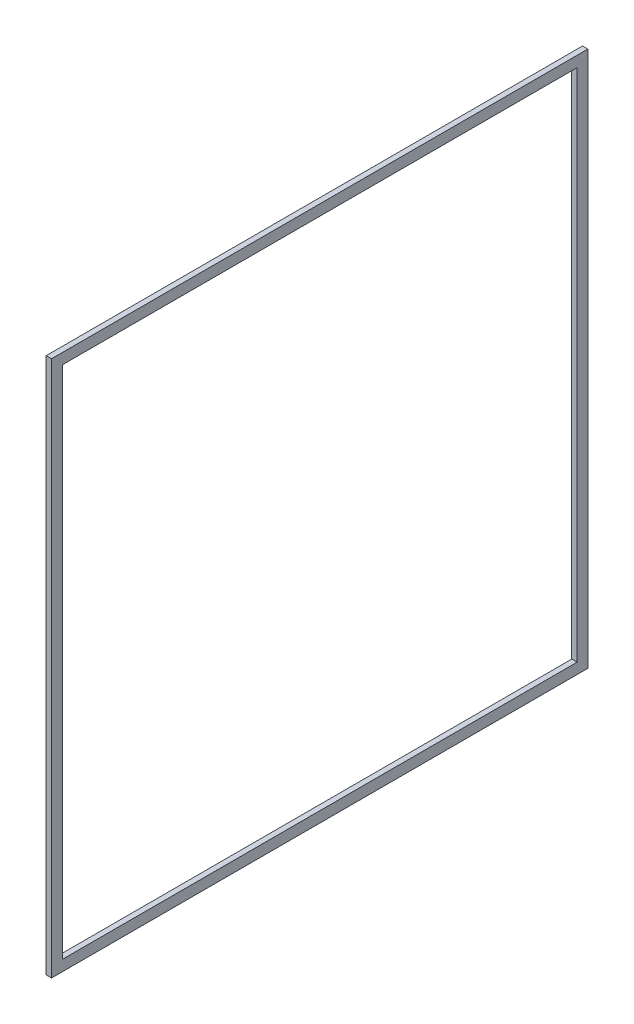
ISO-10303-21;
HEADER;
FILE_DESCRIPTION(('STEP AP214'),'2;1');
FILE_NAME('part.step','',(''),(''),'','','');
FILE_SCHEMA(('AUTOMOTIVE_DESIGN { 1 0 10303 214 1 1 1 1 }'));
ENDSEC;
DATA;
#1=APPLICATION_CONTEXT('core data for automotive mechanical design processes');
#2=APPLICATION_PROTOCOL_DEFINITION('international standard','automotive_design',2000,#1);
#3=PRODUCT_CONTEXT('',#1,'mechanical');
#4=PRODUCT('Part','Part','',(#3));
#5=PRODUCT_RELATED_PRODUCT_CATEGORY('part','',(#4));
#6=PRODUCT_DEFINITION_FORMATION('','',#4);
#7=PRODUCT_DEFINITION_CONTEXT('part definition',#1,'design');
#8=PRODUCT_DEFINITION('design','',#6,#7);
#9=PRODUCT_DEFINITION_SHAPE('','',#8);
#10=(LENGTH_UNIT() NAMED_UNIT(*) SI_UNIT(.MILLI.,.METRE.));
#11=(NAMED_UNIT(*) PLANE_ANGLE_UNIT() SI_UNIT($,.RADIAN.));
#12=(NAMED_UNIT(*) SI_UNIT($,.STERADIAN.) SOLID_ANGLE_UNIT());
#13=UNCERTAINTY_MEASURE_WITH_UNIT(LENGTH_MEASURE(1.E-05),#10,'distance_accuracy_value','');
#14=(GEOMETRIC_REPRESENTATION_CONTEXT(3) GLOBAL_UNCERTAINTY_ASSIGNED_CONTEXT((#13)) GLOBAL_UNIT_ASSIGNED_CONTEXT((#10,
#11,#12)) REPRESENTATION_CONTEXT('',''));
#15=CARTESIAN_POINT('',(0.,0.,0.));
#16=DIRECTION('',(0.,0.,1.));
#17=DIRECTION('',(1.,0.,0.));
#18=AXIS2_PLACEMENT_3D('',#15,#16,#17);
#19=CARTESIAN_POINT('',(0.,0.,152.4));
#20=DIRECTION('',(0.,0.,1.));
#21=DIRECTION('',(1.,0.,0.));
#22=AXIS2_PLACEMENT_3D('',#19,#20,#21);
#23=PLANE('',#22);
#24=DIRECTION('',(1.,0.,0.));
#25=VECTOR('',#24,1.);
#26=CARTESIAN_POINT('',(0.,-152.4,152.4));
#27=LINE('',#26,#25);
#28=CARTESIAN_POINT('',(0.,-152.4,152.4));
#29=VERTEX_POINT('',#28);
#30=CARTESIAN_POINT('',(3.17499999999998,-152.4,152.4));
#31=VERTEX_POINT('',#30);
#32=EDGE_CURVE('E176',#29,#31,#27,.T.);
#33=ORIENTED_EDGE('',*,*,#32,.F.);
#34=DIRECTION('',(0.,1.,0.));
#35=VECTOR('',#34,1.);
#36=CARTESIAN_POINT('',(0.,-158.75,152.4));
#37=LINE('',#36,#35);
#38=CARTESIAN_POINT('',(0.,152.4,152.4));
#39=VERTEX_POINT('',#38);
#40=EDGE_CURVE('E190',#29,#39,#37,.T.);
#41=ORIENTED_EDGE('',*,*,#40,.T.);
#42=DIRECTION('',(1.,0.,0.));
#43=VECTOR('',#42,1.);
#44=CARTESIAN_POINT('',(0.,152.4,152.4));
#45=LINE('',#44,#43);
#46=CARTESIAN_POINT('',(3.17499999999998,152.4,152.4));
#47=VERTEX_POINT('',#46);
#48=EDGE_CURVE('E426',#39,#47,#45,.T.);
#49=ORIENTED_EDGE('',*,*,#48,.T.);
#50=DIRECTION('',(0.,1.,0.));
#51=VECTOR('',#50,1.);
#52=CARTESIAN_POINT('',(3.17499999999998,-158.75,152.4));
#53=LINE('',#52,#51);
#54=EDGE_CURVE('E195',#31,#47,#53,.T.);
#55=ORIENTED_EDGE('',*,*,#54,.F.);
#56=EDGE_LOOP('',(#33,#41,#49,#55));
#57=FACE_BOUND('',#56,.T.);
#58=ADVANCED_FACE('F82',(#57),#23,.F.);
#59=CARTESIAN_POINT('',(0.,0.,-152.4));
#60=DIRECTION('',(0.,0.,-1.));
#61=DIRECTION('',(-1.,0.,0.));
#62=AXIS2_PLACEMENT_3D('',#59,#60,#61);
#63=PLANE('',#62);
#64=DIRECTION('',(1.,0.,0.));
#65=VECTOR('',#64,1.);
#66=CARTESIAN_POINT('',(0.,-152.4,-152.4));
#67=LINE('',#66,#65);
#68=CARTESIAN_POINT('',(0.,-152.4,-152.4));
#69=VERTEX_POINT('',#68);
#70=CARTESIAN_POINT('',(3.17499999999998,-152.4,-152.4));
#71=VERTEX_POINT('',#70);
#72=EDGE_CURVE('E99',#69,#71,#67,.T.);
#73=ORIENTED_EDGE('',*,*,#72,.T.);
#74=DIRECTION('',(0.,-1.,0.));
#75=VECTOR('',#74,1.);
#76=CARTESIAN_POINT('',(3.17499999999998,158.75,-152.4));
#77=LINE('',#76,#75);
#78=CARTESIAN_POINT('',(3.17499999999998,152.4,-152.4));
#79=VERTEX_POINT('',#78);
#80=EDGE_CURVE('E440',#79,#71,#77,.T.);
#81=ORIENTED_EDGE('',*,*,#80,.F.);
#82=DIRECTION('',(1.,0.,0.));
#83=VECTOR('',#82,1.);
#84=CARTESIAN_POINT('',(0.,152.4,-152.4));
#85=LINE('',#84,#83);
#86=CARTESIAN_POINT('',(0.,152.4,-152.4));
#87=VERTEX_POINT('',#86);
#88=EDGE_CURVE('E435',#87,#79,#85,.T.);
#89=ORIENTED_EDGE('',*,*,#88,.F.);
#90=DIRECTION('',(0.,-1.,0.));
#91=VECTOR('',#90,1.);
#92=CARTESIAN_POINT('',(0.,158.75,-152.4));
#93=LINE('',#92,#91);
#94=EDGE_CURVE('E104',#87,#69,#93,.T.);
#95=ORIENTED_EDGE('',*,*,#94,.T.);
#96=EDGE_LOOP('',(#73,#81,#89,#95));
#97=FACE_BOUND('',#96,.T.);
#98=ADVANCED_FACE('F569',(#97),#63,.F.);
#99=CARTESIAN_POINT('',(3.17499999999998,0.,0.));
#100=DIRECTION('',(1.,0.,0.));
#101=DIRECTION('',(0.,0.,-1.));
#102=AXIS2_PLACEMENT_3D('',#99,#100,#101);
#103=PLANE('',#102);
#104=DIRECTION('',(0.,0.,1.));
#105=VECTOR('',#104,1.);
#106=CARTESIAN_POINT('',(3.17499999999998,-152.4,-152.4));
#107=LINE('',#106,#105);
#108=EDGE_CURVE('E314',#71,#31,#107,.T.);
#109=ORIENTED_EDGE('',*,*,#108,.T.);
#110=ORIENTED_EDGE('',*,*,#54,.T.);
#111=DIRECTION('',(0.,0.,-1.));
#112=VECTOR('',#111,1.);
#113=CARTESIAN_POINT('',(3.17499999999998,152.4,152.4));
#114=LINE('',#113,#112);
#115=EDGE_CURVE('E419',#47,#79,#114,.T.);
#116=ORIENTED_EDGE('',*,*,#115,.T.);
#117=ORIENTED_EDGE('',*,*,#80,.T.);
#118=EDGE_LOOP('',(#109,#110,#116,#117));
#119=FACE_BOUND('',#118,.T.);
#120=DIRECTION('',(0.,0.,-1.));
#121=VECTOR('',#120,1.);
#122=CARTESIAN_POINT('',(3.17499999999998,-158.75,158.75));
#123=LINE('',#122,#121);
#124=CARTESIAN_POINT('',(3.17499999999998,-158.75,158.75));
#125=VERTEX_POINT('',#124);
#126=CARTESIAN_POINT('',(3.17499999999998,-158.75,152.4));
#127=VERTEX_POINT('',#126);
#128=EDGE_CURVE('E388',#125,#127,#123,.T.);
#129=ORIENTED_EDGE('',*,*,#128,.T.);
#130=DIRECTION('',(0.,0.,-1.));
#131=VECTOR('',#130,1.);
#132=CARTESIAN_POINT('',(3.17499999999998,-158.75,152.4));
#133=LINE('',#132,#131);
#134=CARTESIAN_POINT('',(3.17499999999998,-158.75,-152.4));
#135=VERTEX_POINT('',#134);
#136=EDGE_CURVE('E303',#127,#135,#133,.T.);
#137=ORIENTED_EDGE('',*,*,#136,.T.);
#138=DIRECTION('',(0.,0.,-1.));
#139=VECTOR('',#138,1.);
#140=CARTESIAN_POINT('',(3.17499999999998,-158.75,-152.4));
#141=LINE('',#140,#139);
#142=CARTESIAN_POINT('',(3.17499999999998,-158.75,-158.75));
#143=VERTEX_POINT('',#142);
#144=EDGE_CURVE('E326',#135,#143,#141,.T.);
#145=ORIENTED_EDGE('',*,*,#144,.T.);
#146=DIRECTION('',(0.,1.,0.));
#147=VECTOR('',#146,1.);
#148=CARTESIAN_POINT('',(3.17499999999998,-158.75,-158.75));
#149=LINE('',#148,#147);
#150=CARTESIAN_POINT('',(3.17499999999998,158.75,-158.75));
#151=VERTEX_POINT('',#150);
#152=EDGE_CURVE('E447',#143,#151,#149,.T.);
#153=ORIENTED_EDGE('',*,*,#152,.T.);
#154=DIRECTION('',(0.,0.,1.));
#155=VECTOR('',#154,1.);
#156=CARTESIAN_POINT('',(3.17499999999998,158.75,-158.75));
#157=LINE('',#156,#155);
#158=CARTESIAN_POINT('',(3.17499999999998,158.75,-152.4));
#159=VERTEX_POINT('',#158);
#160=EDGE_CURVE('E445',#151,#159,#157,.T.);
#161=ORIENTED_EDGE('',*,*,#160,.T.);
#162=DIRECTION('',(0.,0.,1.));
#163=VECTOR('',#162,1.);
#164=CARTESIAN_POINT('',(3.17499999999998,158.75,-152.4));
#165=LINE('',#164,#163);
#166=CARTESIAN_POINT('',(3.17499999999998,158.75,152.4));
#167=VERTEX_POINT('',#166);
#168=EDGE_CURVE('E411',#159,#167,#165,.T.);
#169=ORIENTED_EDGE('',*,*,#168,.T.);
#170=DIRECTION('',(0.,0.,1.));
#171=VECTOR('',#170,1.);
#172=CARTESIAN_POINT('',(3.17499999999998,158.75,152.4));
#173=LINE('',#172,#171);
#174=CARTESIAN_POINT('',(3.17499999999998,158.75,158.75));
#175=VERTEX_POINT('',#174);
#176=EDGE_CURVE('E95',#167,#175,#173,.T.);
#177=ORIENTED_EDGE('',*,*,#176,.T.);
#178=DIRECTION('',(0.,-1.,0.));
#179=VECTOR('',#178,1.);
#180=CARTESIAN_POINT('',(3.17499999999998,158.75,158.75));
#181=LINE('',#180,#179);
#182=EDGE_CURVE('E12',#175,#125,#181,.T.);
#183=ORIENTED_EDGE('',*,*,#182,.T.);
#184=EDGE_LOOP('',(#129,#137,#145,#153,#161,#169,#177,#183));
#185=FACE_BOUND('',#184,.T.);
#186=ADVANCED_FACE('F83',(#119,#185),#103,.T.);
#187=CARTESIAN_POINT('',(0.,0.,0.));
#188=DIRECTION('',(1.,0.,0.));
#189=DIRECTION('',(0.,0.,-1.));
#190=AXIS2_PLACEMENT_3D('',#187,#188,#189);
#191=PLANE('',#190);
#192=ORIENTED_EDGE('',*,*,#40,.F.);
#193=DIRECTION('',(0.,0.,1.));
#194=VECTOR('',#193,1.);
#195=CARTESIAN_POINT('',(0.,-152.4,-152.4));
#196=LINE('',#195,#194);
#197=EDGE_CURVE('E171',#69,#29,#196,.T.);
#198=ORIENTED_EDGE('',*,*,#197,.F.);
#199=ORIENTED_EDGE('',*,*,#94,.F.);
#200=DIRECTION('',(0.,0.,-1.));
#201=VECTOR('',#200,1.);
#202=CARTESIAN_POINT('',(0.,152.4,152.4));
#203=LINE('',#202,#201);
#204=EDGE_CURVE('E203',#39,#87,#203,.T.);
#205=ORIENTED_EDGE('',*,*,#204,.F.);
#206=EDGE_LOOP('',(#192,#198,#199,#205));
#207=FACE_BOUND('',#206,.T.);
#208=DIRECTION('',(0.,0.,-1.));
#209=VECTOR('',#208,1.);
#210=CARTESIAN_POINT('',(0.,-158.75,158.75));
#211=LINE('',#210,#209);
#212=CARTESIAN_POINT('',(0.,-158.75,158.75));
#213=VERTEX_POINT('',#212);
#214=CARTESIAN_POINT('',(0.,-158.75,152.4));
#215=VERTEX_POINT('',#214);
#216=EDGE_CURVE('E202',#213,#215,#211,.T.);
#217=ORIENTED_EDGE('',*,*,#216,.F.);
#218=DIRECTION('',(0.,-1.,0.));
#219=VECTOR('',#218,1.);
#220=CARTESIAN_POINT('',(0.,158.75,158.75));
#221=LINE('',#220,#219);
#222=CARTESIAN_POINT('',(0.,158.75,158.75));
#223=VERTEX_POINT('',#222);
#224=EDGE_CURVE('E398',#223,#213,#221,.T.);
#225=ORIENTED_EDGE('',*,*,#224,.F.);
#226=DIRECTION('',(0.,0.,1.));
#227=VECTOR('',#226,1.);
#228=CARTESIAN_POINT('',(0.,158.75,152.4));
#229=LINE('',#228,#227);
#230=CARTESIAN_POINT('',(0.,158.75,152.4));
#231=VERTEX_POINT('',#230);
#232=EDGE_CURVE('E204',#231,#223,#229,.T.);
#233=ORIENTED_EDGE('',*,*,#232,.F.);
#234=DIRECTION('',(0.,0.,1.));
#235=VECTOR('',#234,1.);
#236=CARTESIAN_POINT('',(0.,158.75,-152.4));
#237=LINE('',#236,#235);
#238=CARTESIAN_POINT('',(0.,158.75,-152.4));
#239=VERTEX_POINT('',#238);
#240=EDGE_CURVE('E427',#239,#231,#237,.T.);
#241=ORIENTED_EDGE('',*,*,#240,.F.);
#242=DIRECTION('',(0.,0.,1.));
#243=VECTOR('',#242,1.);
#244=CARTESIAN_POINT('',(0.,158.75,-158.75));
#245=LINE('',#244,#243);
#246=CARTESIAN_POINT('',(0.,158.75,-158.75));
#247=VERTEX_POINT('',#246);
#248=EDGE_CURVE('E462',#247,#239,#245,.T.);
#249=ORIENTED_EDGE('',*,*,#248,.F.);
#250=DIRECTION('',(0.,1.,0.));
#251=VECTOR('',#250,1.);
#252=CARTESIAN_POINT('',(0.,-158.75,-158.75));
#253=LINE('',#252,#251);
#254=CARTESIAN_POINT('',(0.,-158.75,-158.75));
#255=VERTEX_POINT('',#254);
#256=EDGE_CURVE('E468',#255,#247,#253,.T.);
#257=ORIENTED_EDGE('',*,*,#256,.F.);
#258=DIRECTION('',(0.,0.,-1.));
#259=VECTOR('',#258,1.);
#260=CARTESIAN_POINT('',(0.,-158.75,-152.4));
#261=LINE('',#260,#259);
#262=CARTESIAN_POINT('',(0.,-158.75,-152.4));
#263=VERTEX_POINT('',#262);
#264=EDGE_CURVE('E371',#263,#255,#261,.T.);
#265=ORIENTED_EDGE('',*,*,#264,.F.);
#266=DIRECTION('',(0.,0.,-1.));
#267=VECTOR('',#266,1.);
#268=CARTESIAN_POINT('',(0.,-158.75,152.4));
#269=LINE('',#268,#267);
#270=EDGE_CURVE('E185',#215,#263,#269,.T.);
#271=ORIENTED_EDGE('',*,*,#270,.F.);
#272=EDGE_LOOP('',(#217,#225,#233,#241,#249,#257,#265,#271));
#273=FACE_BOUND('',#272,.T.);
#274=ADVANCED_FACE('F196',(#207,#273),#191,.F.);
#275=CARTESIAN_POINT('',(0.,158.75,0.));
#276=DIRECTION('',(0.,-1.,0.));
#277=DIRECTION('',(0.,0.,-1.));
#278=AXIS2_PLACEMENT_3D('',#275,#276,#277);
#279=PLANE('',#278);
#280=DIRECTION('',(1.,0.,0.));
#281=VECTOR('',#280,1.);
#282=CARTESIAN_POINT('',(0.,158.75,158.75));
#283=LINE('',#282,#281);
#284=EDGE_CURVE('E405',#223,#175,#283,.T.);
#285=ORIENTED_EDGE('',*,*,#284,.T.);
#286=ORIENTED_EDGE('',*,*,#176,.F.);
#287=ORIENTED_EDGE('',*,*,#168,.F.);
#288=ORIENTED_EDGE('',*,*,#160,.F.);
#289=DIRECTION('',(1.,0.,0.));
#290=VECTOR('',#289,1.);
#291=CARTESIAN_POINT('',(0.,158.75,-158.75));
#292=LINE('',#291,#290);
#293=EDGE_CURVE('E460',#247,#151,#292,.T.);
#294=ORIENTED_EDGE('',*,*,#293,.F.);
#295=ORIENTED_EDGE('',*,*,#248,.T.);
#296=ORIENTED_EDGE('',*,*,#240,.T.);
#297=ORIENTED_EDGE('',*,*,#232,.T.);
#298=EDGE_LOOP('',(#285,#286,#287,#288,#294,#295,#296,#297));
#299=FACE_BOUND('',#298,.T.);
#300=ADVANCED_FACE('F231',(#299),#279,.F.);
#301=CARTESIAN_POINT('',(0.,0.,158.75));
#302=DIRECTION('',(0.,0.,-1.));
#303=DIRECTION('',(-1.,0.,0.));
#304=AXIS2_PLACEMENT_3D('',#301,#302,#303);
#305=PLANE('',#304);
#306=DIRECTION('',(1.,0.,0.));
#307=VECTOR('',#306,1.);
#308=CARTESIAN_POINT('',(0.,-158.75,158.75));
#309=LINE('',#308,#307);
#310=EDGE_CURVE('E395',#213,#125,#309,.T.);
#311=ORIENTED_EDGE('',*,*,#310,.T.);
#312=ORIENTED_EDGE('',*,*,#182,.F.);
#313=ORIENTED_EDGE('',*,*,#284,.F.);
#314=ORIENTED_EDGE('',*,*,#224,.T.);
#315=EDGE_LOOP('',(#311,#312,#313,#314));
#316=FACE_BOUND('',#315,.T.);
#317=ADVANCED_FACE('F340',(#316),#305,.F.);
#318=CARTESIAN_POINT('',(0.,-158.75,0.));
#319=DIRECTION('',(0.,1.,0.));
#320=DIRECTION('',(0.,0.,1.));
#321=AXIS2_PLACEMENT_3D('',#318,#319,#320);
#322=PLANE('',#321);
#323=ORIENTED_EDGE('',*,*,#216,.T.);
#324=ORIENTED_EDGE('',*,*,#270,.T.);
#325=ORIENTED_EDGE('',*,*,#264,.T.);
#326=DIRECTION('',(1.,0.,0.));
#327=VECTOR('',#326,1.);
#328=CARTESIAN_POINT('',(0.,-158.75,-158.75));
#329=LINE('',#328,#327);
#330=EDGE_CURVE('E464',#255,#143,#329,.T.);
#331=ORIENTED_EDGE('',*,*,#330,.T.);
#332=ORIENTED_EDGE('',*,*,#144,.F.);
#333=ORIENTED_EDGE('',*,*,#136,.F.);
#334=ORIENTED_EDGE('',*,*,#128,.F.);
#335=ORIENTED_EDGE('',*,*,#310,.F.);
#336=EDGE_LOOP('',(#323,#324,#325,#331,#332,#333,#334,#335));
#337=FACE_BOUND('',#336,.T.);
#338=ADVANCED_FACE('F332',(#337),#322,.F.);
#339=CARTESIAN_POINT('',(0.,152.4,0.));
#340=DIRECTION('',(0.,1.,0.));
#341=DIRECTION('',(0.,0.,1.));
#342=AXIS2_PLACEMENT_3D('',#339,#340,#341);
#343=PLANE('',#342);
#344=ORIENTED_EDGE('',*,*,#88,.T.);
#345=ORIENTED_EDGE('',*,*,#115,.F.);
#346=ORIENTED_EDGE('',*,*,#48,.F.);
#347=ORIENTED_EDGE('',*,*,#204,.T.);
#348=EDGE_LOOP('',(#344,#345,#346,#347));
#349=FACE_BOUND('',#348,.T.);
#350=ADVANCED_FACE('F235',(#349),#343,.F.);
#351=CARTESIAN_POINT('',(0.,0.,-158.75));
#352=DIRECTION('',(0.,0.,1.));
#353=DIRECTION('',(1.,0.,0.));
#354=AXIS2_PLACEMENT_3D('',#351,#352,#353);
#355=PLANE('',#354);
#356=ORIENTED_EDGE('',*,*,#293,.T.);
#357=ORIENTED_EDGE('',*,*,#152,.F.);
#358=ORIENTED_EDGE('',*,*,#330,.F.);
#359=ORIENTED_EDGE('',*,*,#256,.T.);
#360=EDGE_LOOP('',(#356,#357,#358,#359));
#361=FACE_BOUND('',#360,.T.);
#362=ADVANCED_FACE('F578',(#361),#355,.F.);
#363=CARTESIAN_POINT('',(0.,-152.4,0.));
#364=DIRECTION('',(0.,-1.,0.));
#365=DIRECTION('',(0.,0.,-1.));
#366=AXIS2_PLACEMENT_3D('',#363,#364,#365);
#367=PLANE('',#366);
#368=ORIENTED_EDGE('',*,*,#32,.T.);
#369=ORIENTED_EDGE('',*,*,#108,.F.);
#370=ORIENTED_EDGE('',*,*,#72,.F.);
#371=ORIENTED_EDGE('',*,*,#197,.T.);
#372=EDGE_LOOP('',(#368,#369,#370,#371));
#373=FACE_BOUND('',#372,.T.);
#374=ADVANCED_FACE('F173',(#373),#367,.F.);
#375=CLOSED_SHELL('',(#58,#98,#186,#274,#300,#317,#338,#350,#362,#374));
#376=MANIFOLD_SOLID_BREP('B2',#375);
#377=ADVANCED_BREP_SHAPE_REPRESENTATION('',(#18,#376),#14);
#378=SHAPE_DEFINITION_REPRESENTATION(#9,#377);
ENDSEC;
END-ISO-10303-21;
